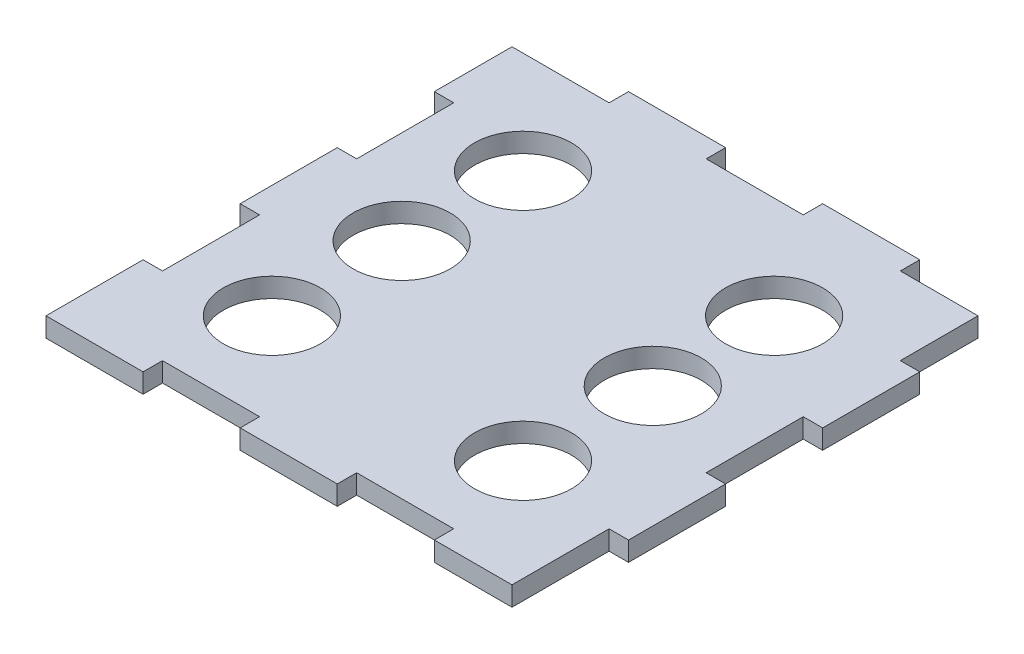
ISO-10303-21;
HEADER;
FILE_DESCRIPTION(('STEP AP214'),'2;1');
FILE_NAME('part.step','',(''),(''),'','','');
FILE_SCHEMA(('AUTOMOTIVE_DESIGN { 1 0 10303 214 1 1 1 1 }'));
ENDSEC;
DATA;
#1=APPLICATION_CONTEXT('core data for automotive mechanical design processes');
#2=APPLICATION_PROTOCOL_DEFINITION('international standard','automotive_design',2000,#1);
#3=PRODUCT_CONTEXT('',#1,'mechanical');
#4=PRODUCT('Part','Part','',(#3));
#5=PRODUCT_RELATED_PRODUCT_CATEGORY('part','',(#4));
#6=PRODUCT_DEFINITION_FORMATION('','',#4);
#7=PRODUCT_DEFINITION_CONTEXT('part definition',#1,'design');
#8=PRODUCT_DEFINITION('design','',#6,#7);
#9=PRODUCT_DEFINITION_SHAPE('','',#8);
#10=(LENGTH_UNIT() NAMED_UNIT(*) SI_UNIT(.MILLI.,.METRE.));
#11=(NAMED_UNIT(*) PLANE_ANGLE_UNIT() SI_UNIT($,.RADIAN.));
#12=(NAMED_UNIT(*) SI_UNIT($,.STERADIAN.) SOLID_ANGLE_UNIT());
#13=UNCERTAINTY_MEASURE_WITH_UNIT(LENGTH_MEASURE(1.E-05),#10,'distance_accuracy_value','');
#14=(GEOMETRIC_REPRESENTATION_CONTEXT(3) GLOBAL_UNCERTAINTY_ASSIGNED_CONTEXT((#13)) GLOBAL_UNIT_ASSIGNED_CONTEXT((#10,
#11,#12)) REPRESENTATION_CONTEXT('',''));
#15=CARTESIAN_POINT('',(0.,0.,0.));
#16=DIRECTION('',(0.,0.,1.));
#17=DIRECTION('',(1.,0.,0.));
#18=AXIS2_PLACEMENT_3D('',#15,#16,#17);
#19=CARTESIAN_POINT('',(0.,4.,0.));
#20=DIRECTION('',(0.,1.,0.));
#21=DIRECTION('',(0.,0.,1.));
#22=AXIS2_PLACEMENT_3D('',#19,#20,#21);
#23=PLANE('',#22);
#24=CARTESIAN_POINT('',(25.,4.,0.));
#25=DIRECTION('',(0.,1.,0.));
#26=DIRECTION('',(0.,0.,1.));
#27=AXIS2_PLACEMENT_3D('',#24,#25,#26);
#28=CIRCLE('',#27,9.99999999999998);
#29=CARTESIAN_POINT('',(25.,4.,9.99999999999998));
#30=VERTEX_POINT('',#29);
#31=EDGE_CURVE('E611',#30,#30,#28,.T.);
#32=ORIENTED_EDGE('',*,*,#31,.F.);
#33=EDGE_LOOP('',(#32));
#34=FACE_BOUND('',#33,.T.);
#35=CARTESIAN_POINT('',(-26.7320869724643,4.,26.7320869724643));
#36=DIRECTION('',(0.,1.,0.));
#37=DIRECTION('',(0.,0.,1.));
#38=AXIS2_PLACEMENT_3D('',#35,#36,#37);
#39=CIRCLE('',#38,10.);
#40=CARTESIAN_POINT('',(-26.7320869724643,4.,36.7320869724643));
#41=VERTEX_POINT('',#40);
#42=EDGE_CURVE('E623',#41,#41,#39,.T.);
#43=ORIENTED_EDGE('',*,*,#42,.F.);
#44=EDGE_LOOP('',(#43));
#45=FACE_BOUND('',#44,.T.);
#46=CARTESIAN_POINT('',(-26.7320869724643,4.,-25.));
#47=DIRECTION('',(0.,1.,0.));
#48=DIRECTION('',(0.,0.,1.));
#49=AXIS2_PLACEMENT_3D('',#46,#47,#48);
#50=CIRCLE('',#49,10.);
#51=CARTESIAN_POINT('',(-26.7320869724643,4.,-15.));
#52=VERTEX_POINT('',#51);
#53=EDGE_CURVE('E302',#52,#52,#50,.T.);
#54=ORIENTED_EDGE('',*,*,#53,.F.);
#55=EDGE_LOOP('',(#54));
#56=FACE_BOUND('',#55,.T.);
#57=DIRECTION('',(0.,0.,-1.));
#58=VECTOR('',#57,1.);
#59=CARTESIAN_POINT('',(46.,4.,30.));
#60=LINE('',#59,#58);
#61=CARTESIAN_POINT('',(46.,4.,50.));
#62=VERTEX_POINT('',#61);
#63=CARTESIAN_POINT('',(46.,4.,30.));
#64=VERTEX_POINT('',#63);
#65=EDGE_CURVE('E369',#62,#64,#60,.T.);
#66=ORIENTED_EDGE('',*,*,#65,.T.);
#67=DIRECTION('',(1.,0.,0.));
#68=VECTOR('',#67,1.);
#69=CARTESIAN_POINT('',(50.,4.,30.));
#70=LINE('',#69,#68);
#71=CARTESIAN_POINT('',(50.,4.,30.));
#72=VERTEX_POINT('',#71);
#73=EDGE_CURVE('E177',#64,#72,#70,.T.);
#74=ORIENTED_EDGE('',*,*,#73,.T.);
#75=DIRECTION('',(0.,0.,-1.));
#76=VECTOR('',#75,1.);
#77=CARTESIAN_POINT('',(50.,4.,9.99999999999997));
#78=LINE('',#77,#76);
#79=CARTESIAN_POINT('',(50.,4.,9.99999999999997));
#80=VERTEX_POINT('',#79);
#81=EDGE_CURVE('E468',#72,#80,#78,.T.);
#82=ORIENTED_EDGE('',*,*,#81,.T.);
#83=DIRECTION('',(-1.,0.,0.));
#84=VECTOR('',#83,1.);
#85=CARTESIAN_POINT('',(46.,4.,9.99999999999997));
#86=LINE('',#85,#84);
#87=CARTESIAN_POINT('',(46.,4.,9.99999999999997));
#88=VERTEX_POINT('',#87);
#89=EDGE_CURVE('E487',#80,#88,#86,.T.);
#90=ORIENTED_EDGE('',*,*,#89,.T.);
#91=DIRECTION('',(0.,0.,-1.));
#92=VECTOR('',#91,1.);
#93=CARTESIAN_POINT('',(46.,4.,-10.));
#94=LINE('',#93,#92);
#95=CARTESIAN_POINT('',(46.,4.,-10.));
#96=VERTEX_POINT('',#95);
#97=EDGE_CURVE('E484',#88,#96,#94,.T.);
#98=ORIENTED_EDGE('',*,*,#97,.T.);
#99=DIRECTION('',(1.,0.,0.));
#100=VECTOR('',#99,1.);
#101=CARTESIAN_POINT('',(50.,4.,-10.));
#102=LINE('',#101,#100);
#103=CARTESIAN_POINT('',(50.,4.,-10.));
#104=VERTEX_POINT('',#103);
#105=EDGE_CURVE('E486',#96,#104,#102,.T.);
#106=ORIENTED_EDGE('',*,*,#105,.T.);
#107=DIRECTION('',(0.,0.,-1.));
#108=VECTOR('',#107,1.);
#109=CARTESIAN_POINT('',(50.,4.,-30.));
#110=LINE('',#109,#108);
#111=CARTESIAN_POINT('',(50.,4.,-30.));
#112=VERTEX_POINT('',#111);
#113=EDGE_CURVE('E489',#104,#112,#110,.T.);
#114=ORIENTED_EDGE('',*,*,#113,.T.);
#115=DIRECTION('',(-1.,0.,0.));
#116=VECTOR('',#115,1.);
#117=CARTESIAN_POINT('',(46.,4.,-30.));
#118=LINE('',#117,#116);
#119=CARTESIAN_POINT('',(46.,4.,-30.));
#120=VERTEX_POINT('',#119);
#121=EDGE_CURVE('E495',#112,#120,#118,.T.);
#122=ORIENTED_EDGE('',*,*,#121,.T.);
#123=DIRECTION('',(0.,0.,-1.));
#124=VECTOR('',#123,1.);
#125=CARTESIAN_POINT('',(46.,4.,-46.));
#126=LINE('',#125,#124);
#127=CARTESIAN_POINT('',(46.,4.,-46.));
#128=VERTEX_POINT('',#127);
#129=EDGE_CURVE('E497',#120,#128,#126,.T.);
#130=ORIENTED_EDGE('',*,*,#129,.T.);
#131=DIRECTION('',(-1.,0.,0.));
#132=VECTOR('',#131,1.);
#133=CARTESIAN_POINT('',(30.,4.,-46.));
#134=LINE('',#133,#132);
#135=CARTESIAN_POINT('',(30.,4.,-46.));
#136=VERTEX_POINT('',#135);
#137=EDGE_CURVE('E499',#128,#136,#134,.T.);
#138=ORIENTED_EDGE('',*,*,#137,.T.);
#139=DIRECTION('',(0.,0.,-1.));
#140=VECTOR('',#139,1.);
#141=CARTESIAN_POINT('',(30.,4.,-50.));
#142=LINE('',#141,#140);
#143=CARTESIAN_POINT('',(30.,4.,-50.));
#144=VERTEX_POINT('',#143);
#145=EDGE_CURVE('E501',#136,#144,#142,.T.);
#146=ORIENTED_EDGE('',*,*,#145,.T.);
#147=DIRECTION('',(-1.,0.,0.));
#148=VECTOR('',#147,1.);
#149=CARTESIAN_POINT('',(9.99999999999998,4.,-50.));
#150=LINE('',#149,#148);
#151=CARTESIAN_POINT('',(9.99999999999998,4.,-50.));
#152=VERTEX_POINT('',#151);
#153=EDGE_CURVE('E503',#144,#152,#150,.T.);
#154=ORIENTED_EDGE('',*,*,#153,.T.);
#155=DIRECTION('',(0.,0.,1.));
#156=VECTOR('',#155,1.);
#157=CARTESIAN_POINT('',(9.99999999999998,4.,-46.));
#158=LINE('',#157,#156);
#159=CARTESIAN_POINT('',(9.99999999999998,4.,-46.));
#160=VERTEX_POINT('',#159);
#161=EDGE_CURVE('E505',#152,#160,#158,.T.);
#162=ORIENTED_EDGE('',*,*,#161,.T.);
#163=DIRECTION('',(-1.,0.,0.));
#164=VECTOR('',#163,1.);
#165=CARTESIAN_POINT('',(-10.,4.,-46.));
#166=LINE('',#165,#164);
#167=CARTESIAN_POINT('',(-10.,4.,-46.));
#168=VERTEX_POINT('',#167);
#169=EDGE_CURVE('E507',#160,#168,#166,.T.);
#170=ORIENTED_EDGE('',*,*,#169,.T.);
#171=DIRECTION('',(0.,0.,-1.));
#172=VECTOR('',#171,1.);
#173=CARTESIAN_POINT('',(-10.,4.,-50.));
#174=LINE('',#173,#172);
#175=CARTESIAN_POINT('',(-10.,4.,-50.));
#176=VERTEX_POINT('',#175);
#177=EDGE_CURVE('E509',#168,#176,#174,.T.);
#178=ORIENTED_EDGE('',*,*,#177,.T.);
#179=DIRECTION('',(-1.,0.,0.));
#180=VECTOR('',#179,1.);
#181=CARTESIAN_POINT('',(-30.,4.,-50.));
#182=LINE('',#181,#180);
#183=CARTESIAN_POINT('',(-30.,4.,-50.));
#184=VERTEX_POINT('',#183);
#185=EDGE_CURVE('E511',#176,#184,#182,.T.);
#186=ORIENTED_EDGE('',*,*,#185,.T.);
#187=DIRECTION('',(0.,0.,1.));
#188=VECTOR('',#187,1.);
#189=CARTESIAN_POINT('',(-30.,4.,-46.));
#190=LINE('',#189,#188);
#191=CARTESIAN_POINT('',(-30.,4.,-46.));
#192=VERTEX_POINT('',#191);
#193=EDGE_CURVE('E513',#184,#192,#190,.T.);
#194=ORIENTED_EDGE('',*,*,#193,.T.);
#195=DIRECTION('',(-1.,0.,0.));
#196=VECTOR('',#195,1.);
#197=CARTESIAN_POINT('',(-50.,4.,-46.));
#198=LINE('',#197,#196);
#199=CARTESIAN_POINT('',(-50.,4.,-46.));
#200=VERTEX_POINT('',#199);
#201=EDGE_CURVE('E515',#192,#200,#198,.T.);
#202=ORIENTED_EDGE('',*,*,#201,.T.);
#203=DIRECTION('',(0.,0.,1.));
#204=VECTOR('',#203,1.);
#205=CARTESIAN_POINT('',(-50.,4.,-46.));
#206=LINE('',#205,#204);
#207=CARTESIAN_POINT('',(-50.,4.,-30.));
#208=VERTEX_POINT('',#207);
#209=EDGE_CURVE('E517',#200,#208,#206,.T.);
#210=ORIENTED_EDGE('',*,*,#209,.T.);
#211=DIRECTION('',(1.,0.,0.));
#212=VECTOR('',#211,1.);
#213=CARTESIAN_POINT('',(-50.,4.,-30.));
#214=LINE('',#213,#212);
#215=CARTESIAN_POINT('',(-46.,4.,-30.));
#216=VERTEX_POINT('',#215);
#217=EDGE_CURVE('E519',#208,#216,#214,.T.);
#218=ORIENTED_EDGE('',*,*,#217,.T.);
#219=DIRECTION('',(0.,0.,1.));
#220=VECTOR('',#219,1.);
#221=CARTESIAN_POINT('',(-46.,4.,-30.));
#222=LINE('',#221,#220);
#223=CARTESIAN_POINT('',(-46.,4.,-10.));
#224=VERTEX_POINT('',#223);
#225=EDGE_CURVE('E521',#216,#224,#222,.T.);
#226=ORIENTED_EDGE('',*,*,#225,.T.);
#227=DIRECTION('',(-1.,0.,0.));
#228=VECTOR('',#227,1.);
#229=CARTESIAN_POINT('',(-46.,4.,-10.));
#230=LINE('',#229,#228);
#231=CARTESIAN_POINT('',(-50.,4.,-10.));
#232=VERTEX_POINT('',#231);
#233=EDGE_CURVE('E523',#224,#232,#230,.T.);
#234=ORIENTED_EDGE('',*,*,#233,.T.);
#235=DIRECTION('',(0.,0.,1.));
#236=VECTOR('',#235,1.);
#237=CARTESIAN_POINT('',(-50.,4.,-10.));
#238=LINE('',#237,#236);
#239=CARTESIAN_POINT('',(-50.,4.,9.99999999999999));
#240=VERTEX_POINT('',#239);
#241=EDGE_CURVE('E525',#232,#240,#238,.T.);
#242=ORIENTED_EDGE('',*,*,#241,.T.);
#243=DIRECTION('',(1.,0.,0.));
#244=VECTOR('',#243,1.);
#245=CARTESIAN_POINT('',(-50.,4.,9.99999999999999));
#246=LINE('',#245,#244);
#247=CARTESIAN_POINT('',(-46.,4.,9.99999999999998));
#248=VERTEX_POINT('',#247);
#249=EDGE_CURVE('E527',#240,#248,#246,.T.);
#250=ORIENTED_EDGE('',*,*,#249,.T.);
#251=DIRECTION('',(0.,0.,1.));
#252=VECTOR('',#251,1.);
#253=CARTESIAN_POINT('',(-46.,4.,9.99999999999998));
#254=LINE('',#253,#252);
#255=CARTESIAN_POINT('',(-46.,4.,30.));
#256=VERTEX_POINT('',#255);
#257=EDGE_CURVE('E529',#248,#256,#254,.T.);
#258=ORIENTED_EDGE('',*,*,#257,.T.);
#259=DIRECTION('',(-1.,0.,0.));
#260=VECTOR('',#259,1.);
#261=CARTESIAN_POINT('',(-46.,4.,30.));
#262=LINE('',#261,#260);
#263=CARTESIAN_POINT('',(-50.,4.,30.));
#264=VERTEX_POINT('',#263);
#265=EDGE_CURVE('E531',#256,#264,#262,.T.);
#266=ORIENTED_EDGE('',*,*,#265,.T.);
#267=DIRECTION('',(0.,0.,1.));
#268=VECTOR('',#267,1.);
#269=CARTESIAN_POINT('',(-50.,4.,30.));
#270=LINE('',#269,#268);
#271=CARTESIAN_POINT('',(-50.,4.,50.));
#272=VERTEX_POINT('',#271);
#273=EDGE_CURVE('E533',#264,#272,#270,.T.);
#274=ORIENTED_EDGE('',*,*,#273,.T.);
#275=DIRECTION('',(1.,0.,0.));
#276=VECTOR('',#275,1.);
#277=CARTESIAN_POINT('',(-50.,4.,50.));
#278=LINE('',#277,#276);
#279=CARTESIAN_POINT('',(-30.,4.,50.));
#280=VERTEX_POINT('',#279);
#281=EDGE_CURVE('E535',#272,#280,#278,.T.);
#282=ORIENTED_EDGE('',*,*,#281,.T.);
#283=DIRECTION('',(0.,0.,-1.));
#284=VECTOR('',#283,1.);
#285=CARTESIAN_POINT('',(-30.,4.,50.));
#286=LINE('',#285,#284);
#287=CARTESIAN_POINT('',(-30.,4.,46.));
#288=VERTEX_POINT('',#287);
#289=EDGE_CURVE('E537',#280,#288,#286,.T.);
#290=ORIENTED_EDGE('',*,*,#289,.T.);
#291=DIRECTION('',(1.,0.,0.));
#292=VECTOR('',#291,1.);
#293=CARTESIAN_POINT('',(-30.,4.,46.));
#294=LINE('',#293,#292);
#295=CARTESIAN_POINT('',(-10.,4.,46.));
#296=VERTEX_POINT('',#295);
#297=EDGE_CURVE('E539',#288,#296,#294,.T.);
#298=ORIENTED_EDGE('',*,*,#297,.T.);
#299=DIRECTION('',(0.,0.,1.));
#300=VECTOR('',#299,1.);
#301=CARTESIAN_POINT('',(-10.,4.,46.));
#302=LINE('',#301,#300);
#303=CARTESIAN_POINT('',(-10.,4.,50.));
#304=VERTEX_POINT('',#303);
#305=EDGE_CURVE('E541',#296,#304,#302,.T.);
#306=ORIENTED_EDGE('',*,*,#305,.T.);
#307=DIRECTION('',(1.,0.,0.));
#308=VECTOR('',#307,1.);
#309=CARTESIAN_POINT('',(-10.,4.,50.));
#310=LINE('',#309,#308);
#311=CARTESIAN_POINT('',(9.99999999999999,4.,50.));
#312=VERTEX_POINT('',#311);
#313=EDGE_CURVE('E543',#304,#312,#310,.T.);
#314=ORIENTED_EDGE('',*,*,#313,.T.);
#315=DIRECTION('',(0.,0.,-1.));
#316=VECTOR('',#315,1.);
#317=CARTESIAN_POINT('',(9.99999999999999,4.,50.));
#318=LINE('',#317,#316);
#319=CARTESIAN_POINT('',(9.99999999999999,4.,46.));
#320=VERTEX_POINT('',#319);
#321=EDGE_CURVE('E280',#312,#320,#318,.T.);
#322=ORIENTED_EDGE('',*,*,#321,.T.);
#323=DIRECTION('',(1.,0.,0.));
#324=VECTOR('',#323,1.);
#325=CARTESIAN_POINT('',(9.99999999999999,4.,46.));
#326=LINE('',#325,#324);
#327=CARTESIAN_POINT('',(30.,4.,46.));
#328=VERTEX_POINT('',#327);
#329=EDGE_CURVE('E274',#320,#328,#326,.T.);
#330=ORIENTED_EDGE('',*,*,#329,.T.);
#331=DIRECTION('',(0.,0.,1.));
#332=VECTOR('',#331,1.);
#333=CARTESIAN_POINT('',(30.,4.,46.));
#334=LINE('',#333,#332);
#335=CARTESIAN_POINT('',(30.,4.,50.));
#336=VERTEX_POINT('',#335);
#337=EDGE_CURVE('E278',#328,#336,#334,.T.);
#338=ORIENTED_EDGE('',*,*,#337,.T.);
#339=DIRECTION('',(1.,0.,0.));
#340=VECTOR('',#339,1.);
#341=CARTESIAN_POINT('',(30.,4.,50.));
#342=LINE('',#341,#340);
#343=EDGE_CURVE('E50',#336,#62,#342,.T.);
#344=ORIENTED_EDGE('',*,*,#343,.T.);
#345=EDGE_LOOP('',(#66,#74,#82,#90,#98,#106,#114,#122,#130,#138,#146,#154,#162,#170,#178,#186,
#194,#202,#210,#218,#226,#234,#242,#250,#258,#266,#274,#282,#290,#298,#306,#314,#322,#330,#338,#344));
#346=FACE_BOUND('',#345,.T.);
#347=CARTESIAN_POINT('',(-26.7320869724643,4.,0.));
#348=DIRECTION('',(0.,1.,0.));
#349=DIRECTION('',(0.,0.,1.));
#350=AXIS2_PLACEMENT_3D('',#347,#348,#349);
#351=CIRCLE('',#350,9.99999999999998);
#352=CARTESIAN_POINT('',(-26.7320869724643,4.,10.));
#353=VERTEX_POINT('',#352);
#354=EDGE_CURVE('E629',#353,#353,#351,.T.);
#355=ORIENTED_EDGE('',*,*,#354,.F.);
#356=EDGE_LOOP('',(#355));
#357=FACE_BOUND('',#356,.T.);
#358=CARTESIAN_POINT('',(25.,4.,-25.));
#359=DIRECTION('',(0.,1.,0.));
#360=DIRECTION('',(0.,0.,1.));
#361=AXIS2_PLACEMENT_3D('',#358,#359,#360);
#362=CIRCLE('',#361,10.);
#363=CARTESIAN_POINT('',(25.,4.,-15.));
#364=VERTEX_POINT('',#363);
#365=EDGE_CURVE('E617',#364,#364,#362,.T.);
#366=ORIENTED_EDGE('',*,*,#365,.F.);
#367=EDGE_LOOP('',(#366));
#368=FACE_BOUND('',#367,.T.);
#369=CARTESIAN_POINT('',(25.,4.,26.7320869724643));
#370=DIRECTION('',(0.,1.,0.));
#371=DIRECTION('',(0.,0.,1.));
#372=AXIS2_PLACEMENT_3D('',#369,#370,#371);
#373=CIRCLE('',#372,10.);
#374=CARTESIAN_POINT('',(25.,4.,36.7320869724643));
#375=VERTEX_POINT('',#374);
#376=EDGE_CURVE('E602',#375,#375,#373,.T.);
#377=ORIENTED_EDGE('',*,*,#376,.F.);
#378=EDGE_LOOP('',(#377));
#379=FACE_BOUND('',#378,.T.);
#380=ADVANCED_FACE('F33',(#34,#45,#56,#346,#357,#368,#379),#23,.T.);
#381=CARTESIAN_POINT('',(0.,0.,0.));
#382=DIRECTION('',(0.,1.,0.));
#383=DIRECTION('',(0.,0.,1.));
#384=AXIS2_PLACEMENT_3D('',#381,#382,#383);
#385=PLANE('',#384);
#386=DIRECTION('',(0.,0.,-1.));
#387=VECTOR('',#386,1.);
#388=CARTESIAN_POINT('',(46.,0.,30.));
#389=LINE('',#388,#387);
#390=CARTESIAN_POINT('',(46.,0.,50.));
#391=VERTEX_POINT('',#390);
#392=CARTESIAN_POINT('',(46.,0.,30.));
#393=VERTEX_POINT('',#392);
#394=EDGE_CURVE('E298',#391,#393,#389,.T.);
#395=ORIENTED_EDGE('',*,*,#394,.F.);
#396=DIRECTION('',(1.,0.,0.));
#397=VECTOR('',#396,1.);
#398=CARTESIAN_POINT('',(30.,0.,50.));
#399=LINE('',#398,#397);
#400=CARTESIAN_POINT('',(30.,0.,50.));
#401=VERTEX_POINT('',#400);
#402=EDGE_CURVE('E169',#401,#391,#399,.T.);
#403=ORIENTED_EDGE('',*,*,#402,.F.);
#404=DIRECTION('',(0.,0.,1.));
#405=VECTOR('',#404,1.);
#406=CARTESIAN_POINT('',(30.,0.,46.));
#407=LINE('',#406,#405);
#408=CARTESIAN_POINT('',(30.,0.,46.));
#409=VERTEX_POINT('',#408);
#410=EDGE_CURVE('E163',#409,#401,#407,.T.);
#411=ORIENTED_EDGE('',*,*,#410,.F.);
#412=DIRECTION('',(1.,0.,0.));
#413=VECTOR('',#412,1.);
#414=CARTESIAN_POINT('',(9.99999999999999,0.,46.));
#415=LINE('',#414,#413);
#416=CARTESIAN_POINT('',(9.99999999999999,0.,46.));
#417=VERTEX_POINT('',#416);
#418=EDGE_CURVE('E288',#417,#409,#415,.T.);
#419=ORIENTED_EDGE('',*,*,#418,.F.);
#420=DIRECTION('',(0.,0.,-1.));
#421=VECTOR('',#420,1.);
#422=CARTESIAN_POINT('',(9.99999999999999,0.,50.));
#423=LINE('',#422,#421);
#424=CARTESIAN_POINT('',(9.99999999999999,0.,50.));
#425=VERTEX_POINT('',#424);
#426=EDGE_CURVE('E364',#425,#417,#423,.T.);
#427=ORIENTED_EDGE('',*,*,#426,.F.);
#428=DIRECTION('',(1.,0.,0.));
#429=VECTOR('',#428,1.);
#430=CARTESIAN_POINT('',(-10.,0.,50.));
#431=LINE('',#430,#429);
#432=CARTESIAN_POINT('',(-10.,0.,50.));
#433=VERTEX_POINT('',#432);
#434=EDGE_CURVE('E362',#433,#425,#431,.T.);
#435=ORIENTED_EDGE('',*,*,#434,.F.);
#436=DIRECTION('',(0.,0.,1.));
#437=VECTOR('',#436,1.);
#438=CARTESIAN_POINT('',(-10.,0.,46.));
#439=LINE('',#438,#437);
#440=CARTESIAN_POINT('',(-10.,0.,46.));
#441=VERTEX_POINT('',#440);
#442=EDGE_CURVE('E360',#441,#433,#439,.T.);
#443=ORIENTED_EDGE('',*,*,#442,.F.);
#444=DIRECTION('',(1.,0.,0.));
#445=VECTOR('',#444,1.);
#446=CARTESIAN_POINT('',(-30.,0.,46.));
#447=LINE('',#446,#445);
#448=CARTESIAN_POINT('',(-30.,0.,46.));
#449=VERTEX_POINT('',#448);
#450=EDGE_CURVE('E358',#449,#441,#447,.T.);
#451=ORIENTED_EDGE('',*,*,#450,.F.);
#452=DIRECTION('',(0.,0.,-1.));
#453=VECTOR('',#452,1.);
#454=CARTESIAN_POINT('',(-30.,0.,50.));
#455=LINE('',#454,#453);
#456=CARTESIAN_POINT('',(-30.,0.,50.));
#457=VERTEX_POINT('',#456);
#458=EDGE_CURVE('E356',#457,#449,#455,.T.);
#459=ORIENTED_EDGE('',*,*,#458,.F.);
#460=DIRECTION('',(1.,0.,0.));
#461=VECTOR('',#460,1.);
#462=CARTESIAN_POINT('',(-50.,0.,50.));
#463=LINE('',#462,#461);
#464=CARTESIAN_POINT('',(-50.,0.,50.));
#465=VERTEX_POINT('',#464);
#466=EDGE_CURVE('E354',#465,#457,#463,.T.);
#467=ORIENTED_EDGE('',*,*,#466,.F.);
#468=DIRECTION('',(0.,0.,1.));
#469=VECTOR('',#468,1.);
#470=CARTESIAN_POINT('',(-50.,0.,30.));
#471=LINE('',#470,#469);
#472=CARTESIAN_POINT('',(-50.,0.,30.));
#473=VERTEX_POINT('',#472);
#474=EDGE_CURVE('E352',#473,#465,#471,.T.);
#475=ORIENTED_EDGE('',*,*,#474,.F.);
#476=DIRECTION('',(-1.,0.,0.));
#477=VECTOR('',#476,1.);
#478=CARTESIAN_POINT('',(-46.,0.,30.));
#479=LINE('',#478,#477);
#480=CARTESIAN_POINT('',(-46.,0.,30.));
#481=VERTEX_POINT('',#480);
#482=EDGE_CURVE('E350',#481,#473,#479,.T.);
#483=ORIENTED_EDGE('',*,*,#482,.F.);
#484=DIRECTION('',(0.,0.,1.));
#485=VECTOR('',#484,1.);
#486=CARTESIAN_POINT('',(-46.,0.,9.99999999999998));
#487=LINE('',#486,#485);
#488=CARTESIAN_POINT('',(-46.,0.,9.99999999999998));
#489=VERTEX_POINT('',#488);
#490=EDGE_CURVE('E348',#489,#481,#487,.T.);
#491=ORIENTED_EDGE('',*,*,#490,.F.);
#492=DIRECTION('',(1.,0.,0.));
#493=VECTOR('',#492,1.);
#494=CARTESIAN_POINT('',(-50.,0.,9.99999999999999));
#495=LINE('',#494,#493);
#496=CARTESIAN_POINT('',(-50.,0.,9.99999999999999));
#497=VERTEX_POINT('',#496);
#498=EDGE_CURVE('E346',#497,#489,#495,.T.);
#499=ORIENTED_EDGE('',*,*,#498,.F.);
#500=DIRECTION('',(0.,0.,1.));
#501=VECTOR('',#500,1.);
#502=CARTESIAN_POINT('',(-50.,0.,-10.));
#503=LINE('',#502,#501);
#504=CARTESIAN_POINT('',(-50.,0.,-10.));
#505=VERTEX_POINT('',#504);
#506=EDGE_CURVE('E344',#505,#497,#503,.T.);
#507=ORIENTED_EDGE('',*,*,#506,.F.);
#508=DIRECTION('',(-1.,0.,0.));
#509=VECTOR('',#508,1.);
#510=CARTESIAN_POINT('',(-46.,0.,-10.));
#511=LINE('',#510,#509);
#512=CARTESIAN_POINT('',(-46.,0.,-10.));
#513=VERTEX_POINT('',#512);
#514=EDGE_CURVE('E342',#513,#505,#511,.T.);
#515=ORIENTED_EDGE('',*,*,#514,.F.);
#516=DIRECTION('',(0.,0.,1.));
#517=VECTOR('',#516,1.);
#518=CARTESIAN_POINT('',(-46.,0.,-30.));
#519=LINE('',#518,#517);
#520=CARTESIAN_POINT('',(-46.,0.,-30.));
#521=VERTEX_POINT('',#520);
#522=EDGE_CURVE('E340',#521,#513,#519,.T.);
#523=ORIENTED_EDGE('',*,*,#522,.F.);
#524=DIRECTION('',(1.,0.,0.));
#525=VECTOR('',#524,1.);
#526=CARTESIAN_POINT('',(-50.,0.,-30.));
#527=LINE('',#526,#525);
#528=CARTESIAN_POINT('',(-50.,0.,-30.));
#529=VERTEX_POINT('',#528);
#530=EDGE_CURVE('E338',#529,#521,#527,.T.);
#531=ORIENTED_EDGE('',*,*,#530,.F.);
#532=DIRECTION('',(0.,0.,1.));
#533=VECTOR('',#532,1.);
#534=CARTESIAN_POINT('',(-50.,0.,-46.));
#535=LINE('',#534,#533);
#536=CARTESIAN_POINT('',(-50.,0.,-46.));
#537=VERTEX_POINT('',#536);
#538=EDGE_CURVE('E336',#537,#529,#535,.T.);
#539=ORIENTED_EDGE('',*,*,#538,.F.);
#540=DIRECTION('',(-1.,0.,0.));
#541=VECTOR('',#540,1.);
#542=CARTESIAN_POINT('',(-50.,0.,-46.));
#543=LINE('',#542,#541);
#544=CARTESIAN_POINT('',(-30.,0.,-46.));
#545=VERTEX_POINT('',#544);
#546=EDGE_CURVE('E334',#545,#537,#543,.T.);
#547=ORIENTED_EDGE('',*,*,#546,.F.);
#548=DIRECTION('',(0.,0.,1.));
#549=VECTOR('',#548,1.);
#550=CARTESIAN_POINT('',(-30.,0.,-46.));
#551=LINE('',#550,#549);
#552=CARTESIAN_POINT('',(-30.,0.,-50.));
#553=VERTEX_POINT('',#552);
#554=EDGE_CURVE('E332',#553,#545,#551,.T.);
#555=ORIENTED_EDGE('',*,*,#554,.F.);
#556=DIRECTION('',(-1.,0.,0.));
#557=VECTOR('',#556,1.);
#558=CARTESIAN_POINT('',(-30.,0.,-50.));
#559=LINE('',#558,#557);
#560=CARTESIAN_POINT('',(-10.,0.,-50.));
#561=VERTEX_POINT('',#560);
#562=EDGE_CURVE('E330',#561,#553,#559,.T.);
#563=ORIENTED_EDGE('',*,*,#562,.F.);
#564=DIRECTION('',(0.,0.,-1.));
#565=VECTOR('',#564,1.);
#566=CARTESIAN_POINT('',(-10.,0.,-50.));
#567=LINE('',#566,#565);
#568=CARTESIAN_POINT('',(-10.,0.,-46.));
#569=VERTEX_POINT('',#568);
#570=EDGE_CURVE('E328',#569,#561,#567,.T.);
#571=ORIENTED_EDGE('',*,*,#570,.F.);
#572=DIRECTION('',(-1.,0.,0.));
#573=VECTOR('',#572,1.);
#574=CARTESIAN_POINT('',(-10.,0.,-46.));
#575=LINE('',#574,#573);
#576=CARTESIAN_POINT('',(9.99999999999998,0.,-46.));
#577=VERTEX_POINT('',#576);
#578=EDGE_CURVE('E326',#577,#569,#575,.T.);
#579=ORIENTED_EDGE('',*,*,#578,.F.);
#580=DIRECTION('',(0.,0.,1.));
#581=VECTOR('',#580,1.);
#582=CARTESIAN_POINT('',(9.99999999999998,0.,-46.));
#583=LINE('',#582,#581);
#584=CARTESIAN_POINT('',(9.99999999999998,0.,-50.));
#585=VERTEX_POINT('',#584);
#586=EDGE_CURVE('E324',#585,#577,#583,.T.);
#587=ORIENTED_EDGE('',*,*,#586,.F.);
#588=DIRECTION('',(-1.,0.,0.));
#589=VECTOR('',#588,1.);
#590=CARTESIAN_POINT('',(9.99999999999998,0.,-50.));
#591=LINE('',#590,#589);
#592=CARTESIAN_POINT('',(30.,0.,-50.));
#593=VERTEX_POINT('',#592);
#594=EDGE_CURVE('E322',#593,#585,#591,.T.);
#595=ORIENTED_EDGE('',*,*,#594,.F.);
#596=DIRECTION('',(0.,0.,-1.));
#597=VECTOR('',#596,1.);
#598=CARTESIAN_POINT('',(30.,0.,-50.));
#599=LINE('',#598,#597);
#600=CARTESIAN_POINT('',(30.,0.,-46.));
#601=VERTEX_POINT('',#600);
#602=EDGE_CURVE('E320',#601,#593,#599,.T.);
#603=ORIENTED_EDGE('',*,*,#602,.F.);
#604=DIRECTION('',(-1.,0.,0.));
#605=VECTOR('',#604,1.);
#606=CARTESIAN_POINT('',(30.,0.,-46.));
#607=LINE('',#606,#605);
#608=CARTESIAN_POINT('',(46.,0.,-46.));
#609=VERTEX_POINT('',#608);
#610=EDGE_CURVE('E318',#609,#601,#607,.T.);
#611=ORIENTED_EDGE('',*,*,#610,.F.);
#612=DIRECTION('',(0.,0.,-1.));
#613=VECTOR('',#612,1.);
#614=CARTESIAN_POINT('',(46.,0.,-46.));
#615=LINE('',#614,#613);
#616=CARTESIAN_POINT('',(46.,0.,-30.));
#617=VERTEX_POINT('',#616);
#618=EDGE_CURVE('E316',#617,#609,#615,.T.);
#619=ORIENTED_EDGE('',*,*,#618,.F.);
#620=DIRECTION('',(-1.,0.,0.));
#621=VECTOR('',#620,1.);
#622=CARTESIAN_POINT('',(46.,0.,-30.));
#623=LINE('',#622,#621);
#624=CARTESIAN_POINT('',(50.,0.,-30.));
#625=VERTEX_POINT('',#624);
#626=EDGE_CURVE('E314',#625,#617,#623,.T.);
#627=ORIENTED_EDGE('',*,*,#626,.F.);
#628=DIRECTION('',(0.,0.,-1.));
#629=VECTOR('',#628,1.);
#630=CARTESIAN_POINT('',(50.,0.,-30.));
#631=LINE('',#630,#629);
#632=CARTESIAN_POINT('',(50.,0.,-10.));
#633=VERTEX_POINT('',#632);
#634=EDGE_CURVE('E312',#633,#625,#631,.T.);
#635=ORIENTED_EDGE('',*,*,#634,.F.);
#636=DIRECTION('',(1.,0.,0.));
#637=VECTOR('',#636,1.);
#638=CARTESIAN_POINT('',(50.,0.,-10.));
#639=LINE('',#638,#637);
#640=CARTESIAN_POINT('',(46.,0.,-10.));
#641=VERTEX_POINT('',#640);
#642=EDGE_CURVE('E310',#641,#633,#639,.T.);
#643=ORIENTED_EDGE('',*,*,#642,.F.);
#644=DIRECTION('',(0.,0.,-1.));
#645=VECTOR('',#644,1.);
#646=CARTESIAN_POINT('',(46.,0.,-10.));
#647=LINE('',#646,#645);
#648=CARTESIAN_POINT('',(46.,0.,9.99999999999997));
#649=VERTEX_POINT('',#648);
#650=EDGE_CURVE('E308',#649,#641,#647,.T.);
#651=ORIENTED_EDGE('',*,*,#650,.F.);
#652=DIRECTION('',(-1.,0.,0.));
#653=VECTOR('',#652,1.);
#654=CARTESIAN_POINT('',(46.,0.,9.99999999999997));
#655=LINE('',#654,#653);
#656=CARTESIAN_POINT('',(50.,0.,9.99999999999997));
#657=VERTEX_POINT('',#656);
#658=EDGE_CURVE('E306',#657,#649,#655,.T.);
#659=ORIENTED_EDGE('',*,*,#658,.F.);
#660=DIRECTION('',(0.,0.,-1.));
#661=VECTOR('',#660,1.);
#662=CARTESIAN_POINT('',(50.,0.,9.99999999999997));
#663=LINE('',#662,#661);
#664=CARTESIAN_POINT('',(50.,0.,30.));
#665=VERTEX_POINT('',#664);
#666=EDGE_CURVE('E304',#665,#657,#663,.T.);
#667=ORIENTED_EDGE('',*,*,#666,.F.);
#668=DIRECTION('',(1.,0.,0.));
#669=VECTOR('',#668,1.);
#670=CARTESIAN_POINT('',(50.,0.,30.));
#671=LINE('',#670,#669);
#672=EDGE_CURVE('E301',#393,#665,#671,.T.);
#673=ORIENTED_EDGE('',*,*,#672,.F.);
#674=EDGE_LOOP('',(#395,#403,#411,#419,#427,#435,#443,#451,#459,#467,#475,#483,#491,#499,#507,
#515,#523,#531,#539,#547,#555,#563,#571,#579,#587,#595,#603,#611,#619,#627,#635,#643,#651,#659,
#667,#673));
#675=FACE_BOUND('',#674,.T.);
#676=CARTESIAN_POINT('',(-26.7320869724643,0.,-25.));
#677=DIRECTION('',(0.,1.,0.));
#678=DIRECTION('',(0.,0.,1.));
#679=AXIS2_PLACEMENT_3D('',#676,#677,#678);
#680=CIRCLE('',#679,10.);
#681=CARTESIAN_POINT('',(-26.7320869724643,0.,-15.));
#682=VERTEX_POINT('',#681);
#683=EDGE_CURVE('E632',#682,#682,#680,.T.);
#684=ORIENTED_EDGE('',*,*,#683,.T.);
#685=EDGE_LOOP('',(#684));
#686=FACE_BOUND('',#685,.T.);
#687=CARTESIAN_POINT('',(-26.7320869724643,0.,0.));
#688=DIRECTION('',(0.,1.,0.));
#689=DIRECTION('',(0.,0.,1.));
#690=AXIS2_PLACEMENT_3D('',#687,#688,#689);
#691=CIRCLE('',#690,9.99999999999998);
#692=CARTESIAN_POINT('',(-26.7320869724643,0.,10.));
#693=VERTEX_POINT('',#692);
#694=EDGE_CURVE('E626',#693,#693,#691,.T.);
#695=ORIENTED_EDGE('',*,*,#694,.T.);
#696=EDGE_LOOP('',(#695));
#697=FACE_BOUND('',#696,.T.);
#698=CARTESIAN_POINT('',(-26.7320869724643,0.,26.7320869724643));
#699=DIRECTION('',(0.,1.,0.));
#700=DIRECTION('',(0.,0.,1.));
#701=AXIS2_PLACEMENT_3D('',#698,#699,#700);
#702=CIRCLE('',#701,10.);
#703=CARTESIAN_POINT('',(-26.7320869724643,0.,36.7320869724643));
#704=VERTEX_POINT('',#703);
#705=EDGE_CURVE('E620',#704,#704,#702,.T.);
#706=ORIENTED_EDGE('',*,*,#705,.T.);
#707=EDGE_LOOP('',(#706));
#708=FACE_BOUND('',#707,.T.);
#709=CARTESIAN_POINT('',(25.,0.,-25.));
#710=DIRECTION('',(0.,1.,0.));
#711=DIRECTION('',(0.,0.,1.));
#712=AXIS2_PLACEMENT_3D('',#709,#710,#711);
#713=CIRCLE('',#712,10.);
#714=CARTESIAN_POINT('',(25.,0.,-15.));
#715=VERTEX_POINT('',#714);
#716=EDGE_CURVE('E614',#715,#715,#713,.T.);
#717=ORIENTED_EDGE('',*,*,#716,.T.);
#718=EDGE_LOOP('',(#717));
#719=FACE_BOUND('',#718,.T.);
#720=CARTESIAN_POINT('',(25.,0.,0.));
#721=DIRECTION('',(0.,1.,0.));
#722=DIRECTION('',(0.,0.,1.));
#723=AXIS2_PLACEMENT_3D('',#720,#721,#722);
#724=CIRCLE('',#723,9.99999999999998);
#725=CARTESIAN_POINT('',(25.,0.,9.99999999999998));
#726=VERTEX_POINT('',#725);
#727=EDGE_CURVE('E608',#726,#726,#724,.T.);
#728=ORIENTED_EDGE('',*,*,#727,.T.);
#729=EDGE_LOOP('',(#728));
#730=FACE_BOUND('',#729,.T.);
#731=CARTESIAN_POINT('',(25.,0.,26.7320869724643));
#732=DIRECTION('',(0.,1.,0.));
#733=DIRECTION('',(0.,0.,1.));
#734=AXIS2_PLACEMENT_3D('',#731,#732,#733);
#735=CIRCLE('',#734,10.);
#736=CARTESIAN_POINT('',(25.,0.,36.7320869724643));
#737=VERTEX_POINT('',#736);
#738=EDGE_CURVE('E605',#737,#737,#735,.T.);
#739=ORIENTED_EDGE('',*,*,#738,.T.);
#740=EDGE_LOOP('',(#739));
#741=FACE_BOUND('',#740,.T.);
#742=ADVANCED_FACE('F472',(#675,#686,#697,#708,#719,#730,#741),#385,.F.);
#743=CARTESIAN_POINT('',(46.,4.,30.));
#744=DIRECTION('',(-1.,0.,0.));
#745=DIRECTION('',(0.,0.,1.));
#746=AXIS2_PLACEMENT_3D('',#743,#744,#745);
#747=PLANE('',#746);
#748=ORIENTED_EDGE('',*,*,#394,.T.);
#749=DIRECTION('',(0.,-1.,0.));
#750=VECTOR('',#749,1.);
#751=CARTESIAN_POINT('',(46.,4.,30.));
#752=LINE('',#751,#750);
#753=EDGE_CURVE('E11',#64,#393,#752,.T.);
#754=ORIENTED_EDGE('',*,*,#753,.F.);
#755=ORIENTED_EDGE('',*,*,#65,.F.);
#756=DIRECTION('',(0.,-1.,0.));
#757=VECTOR('',#756,1.);
#758=CARTESIAN_POINT('',(46.,4.,50.));
#759=LINE('',#758,#757);
#760=EDGE_CURVE('E294',#62,#391,#759,.T.);
#761=ORIENTED_EDGE('',*,*,#760,.T.);
#762=EDGE_LOOP('',(#748,#754,#755,#761));
#763=FACE_BOUND('',#762,.T.);
#764=ADVANCED_FACE('F35',(#763),#747,.F.);
#765=CARTESIAN_POINT('',(50.,4.,30.));
#766=DIRECTION('',(0.,0.,-1.));
#767=DIRECTION('',(-1.,0.,0.));
#768=AXIS2_PLACEMENT_3D('',#765,#766,#767);
#769=PLANE('',#768);
#770=ORIENTED_EDGE('',*,*,#672,.T.);
#771=DIRECTION('',(0.,-1.,0.));
#772=VECTOR('',#771,1.);
#773=CARTESIAN_POINT('',(50.,4.,30.));
#774=LINE('',#773,#772);
#775=EDGE_CURVE('E42',#72,#665,#774,.T.);
#776=ORIENTED_EDGE('',*,*,#775,.F.);
#777=ORIENTED_EDGE('',*,*,#73,.F.);
#778=ORIENTED_EDGE('',*,*,#753,.T.);
#779=EDGE_LOOP('',(#770,#776,#777,#778));
#780=FACE_BOUND('',#779,.T.);
#781=ADVANCED_FACE('F1000',(#780),#769,.F.);
#782=CARTESIAN_POINT('',(50.,4.,9.99999999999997));
#783=DIRECTION('',(-1.,0.,0.));
#784=DIRECTION('',(0.,0.,1.));
#785=AXIS2_PLACEMENT_3D('',#782,#783,#784);
#786=PLANE('',#785);
#787=ORIENTED_EDGE('',*,*,#666,.T.);
#788=DIRECTION('',(0.,-1.,0.));
#789=VECTOR('',#788,1.);
#790=CARTESIAN_POINT('',(50.,4.,9.99999999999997));
#791=LINE('',#790,#789);
#792=EDGE_CURVE('E460',#80,#657,#791,.T.);
#793=ORIENTED_EDGE('',*,*,#792,.F.);
#794=ORIENTED_EDGE('',*,*,#81,.F.);
#795=ORIENTED_EDGE('',*,*,#775,.T.);
#796=EDGE_LOOP('',(#787,#793,#794,#795));
#797=FACE_BOUND('',#796,.T.);
#798=ADVANCED_FACE('F466',(#797),#786,.F.);
#799=CARTESIAN_POINT('',(46.,4.,9.99999999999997));
#800=DIRECTION('',(0.,0.,1.));
#801=DIRECTION('',(1.,0.,0.));
#802=AXIS2_PLACEMENT_3D('',#799,#800,#801);
#803=PLANE('',#802);
#804=ORIENTED_EDGE('',*,*,#658,.T.);
#805=DIRECTION('',(0.,-1.,0.));
#806=VECTOR('',#805,1.);
#807=CARTESIAN_POINT('',(46.,4.,9.99999999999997));
#808=LINE('',#807,#806);
#809=EDGE_CURVE('E457',#88,#649,#808,.T.);
#810=ORIENTED_EDGE('',*,*,#809,.F.);
#811=ORIENTED_EDGE('',*,*,#89,.F.);
#812=ORIENTED_EDGE('',*,*,#792,.T.);
#813=EDGE_LOOP('',(#804,#810,#811,#812));
#814=FACE_BOUND('',#813,.T.);
#815=ADVANCED_FACE('F478',(#814),#803,.F.);
#816=CARTESIAN_POINT('',(46.,4.,-10.));
#817=DIRECTION('',(-1.,0.,0.));
#818=DIRECTION('',(0.,0.,1.));
#819=AXIS2_PLACEMENT_3D('',#816,#817,#818);
#820=PLANE('',#819);
#821=ORIENTED_EDGE('',*,*,#650,.T.);
#822=DIRECTION('',(0.,-1.,0.));
#823=VECTOR('',#822,1.);
#824=CARTESIAN_POINT('',(46.,4.,-10.));
#825=LINE('',#824,#823);
#826=EDGE_CURVE('E454',#96,#641,#825,.T.);
#827=ORIENTED_EDGE('',*,*,#826,.F.);
#828=ORIENTED_EDGE('',*,*,#97,.F.);
#829=ORIENTED_EDGE('',*,*,#809,.T.);
#830=EDGE_LOOP('',(#821,#827,#828,#829));
#831=FACE_BOUND('',#830,.T.);
#832=ADVANCED_FACE('F482',(#831),#820,.F.);
#833=CARTESIAN_POINT('',(50.,4.,-10.));
#834=DIRECTION('',(0.,0.,-1.));
#835=DIRECTION('',(-1.,0.,0.));
#836=AXIS2_PLACEMENT_3D('',#833,#834,#835);
#837=PLANE('',#836);
#838=ORIENTED_EDGE('',*,*,#642,.T.);
#839=DIRECTION('',(0.,-1.,0.));
#840=VECTOR('',#839,1.);
#841=CARTESIAN_POINT('',(50.,4.,-10.));
#842=LINE('',#841,#840);
#843=EDGE_CURVE('E451',#104,#633,#842,.T.);
#844=ORIENTED_EDGE('',*,*,#843,.F.);
#845=ORIENTED_EDGE('',*,*,#105,.F.);
#846=ORIENTED_EDGE('',*,*,#826,.T.);
#847=EDGE_LOOP('',(#838,#844,#845,#846));
#848=FACE_BOUND('',#847,.T.);
#849=ADVANCED_FACE('F965',(#848),#837,.F.);
#850=CARTESIAN_POINT('',(50.,4.,-30.));
#851=DIRECTION('',(-1.,0.,0.));
#852=DIRECTION('',(0.,0.,1.));
#853=AXIS2_PLACEMENT_3D('',#850,#851,#852);
#854=PLANE('',#853);
#855=ORIENTED_EDGE('',*,*,#634,.T.);
#856=DIRECTION('',(0.,-1.,0.));
#857=VECTOR('',#856,1.);
#858=CARTESIAN_POINT('',(50.,4.,-30.));
#859=LINE('',#858,#857);
#860=EDGE_CURVE('E448',#112,#625,#859,.T.);
#861=ORIENTED_EDGE('',*,*,#860,.F.);
#862=ORIENTED_EDGE('',*,*,#113,.F.);
#863=ORIENTED_EDGE('',*,*,#843,.T.);
#864=EDGE_LOOP('',(#855,#861,#862,#863));
#865=FACE_BOUND('',#864,.T.);
#866=ADVANCED_FACE('F955',(#865),#854,.F.);
#867=CARTESIAN_POINT('',(46.,4.,-30.));
#868=DIRECTION('',(0.,0.,1.));
#869=DIRECTION('',(1.,0.,0.));
#870=AXIS2_PLACEMENT_3D('',#867,#868,#869);
#871=PLANE('',#870);
#872=ORIENTED_EDGE('',*,*,#626,.T.);
#873=DIRECTION('',(0.,-1.,0.));
#874=VECTOR('',#873,1.);
#875=CARTESIAN_POINT('',(46.,4.,-30.));
#876=LINE('',#875,#874);
#877=EDGE_CURVE('E445',#120,#617,#876,.T.);
#878=ORIENTED_EDGE('',*,*,#877,.F.);
#879=ORIENTED_EDGE('',*,*,#121,.F.);
#880=ORIENTED_EDGE('',*,*,#860,.T.);
#881=EDGE_LOOP('',(#872,#878,#879,#880));
#882=FACE_BOUND('',#881,.T.);
#883=ADVANCED_FACE('F945',(#882),#871,.F.);
#884=CARTESIAN_POINT('',(46.,4.,-46.));
#885=DIRECTION('',(-1.,0.,0.));
#886=DIRECTION('',(0.,0.,1.));
#887=AXIS2_PLACEMENT_3D('',#884,#885,#886);
#888=PLANE('',#887);
#889=ORIENTED_EDGE('',*,*,#618,.T.);
#890=DIRECTION('',(0.,-1.,0.));
#891=VECTOR('',#890,1.);
#892=CARTESIAN_POINT('',(46.,4.,-46.));
#893=LINE('',#892,#891);
#894=EDGE_CURVE('E442',#128,#609,#893,.T.);
#895=ORIENTED_EDGE('',*,*,#894,.F.);
#896=ORIENTED_EDGE('',*,*,#129,.F.);
#897=ORIENTED_EDGE('',*,*,#877,.T.);
#898=EDGE_LOOP('',(#889,#895,#896,#897));
#899=FACE_BOUND('',#898,.T.);
#900=ADVANCED_FACE('F935',(#899),#888,.F.);
#901=CARTESIAN_POINT('',(30.,4.,-46.));
#902=DIRECTION('',(0.,0.,1.));
#903=DIRECTION('',(1.,0.,0.));
#904=AXIS2_PLACEMENT_3D('',#901,#902,#903);
#905=PLANE('',#904);
#906=ORIENTED_EDGE('',*,*,#610,.T.);
#907=DIRECTION('',(0.,-1.,0.));
#908=VECTOR('',#907,1.);
#909=CARTESIAN_POINT('',(30.,4.,-46.));
#910=LINE('',#909,#908);
#911=EDGE_CURVE('E439',#136,#601,#910,.T.);
#912=ORIENTED_EDGE('',*,*,#911,.F.);
#913=ORIENTED_EDGE('',*,*,#137,.F.);
#914=ORIENTED_EDGE('',*,*,#894,.T.);
#915=EDGE_LOOP('',(#906,#912,#913,#914));
#916=FACE_BOUND('',#915,.T.);
#917=ADVANCED_FACE('F925',(#916),#905,.F.);
#918=CARTESIAN_POINT('',(30.,4.,-50.));
#919=DIRECTION('',(-1.,0.,0.));
#920=DIRECTION('',(0.,0.,1.));
#921=AXIS2_PLACEMENT_3D('',#918,#919,#920);
#922=PLANE('',#921);
#923=ORIENTED_EDGE('',*,*,#602,.T.);
#924=DIRECTION('',(0.,-1.,0.));
#925=VECTOR('',#924,1.);
#926=CARTESIAN_POINT('',(30.,4.,-50.));
#927=LINE('',#926,#925);
#928=EDGE_CURVE('E436',#144,#593,#927,.T.);
#929=ORIENTED_EDGE('',*,*,#928,.F.);
#930=ORIENTED_EDGE('',*,*,#145,.F.);
#931=ORIENTED_EDGE('',*,*,#911,.T.);
#932=EDGE_LOOP('',(#923,#929,#930,#931));
#933=FACE_BOUND('',#932,.T.);
#934=ADVANCED_FACE('F915',(#933),#922,.F.);
#935=CARTESIAN_POINT('',(9.99999999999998,4.,-50.));
#936=DIRECTION('',(0.,0.,1.));
#937=DIRECTION('',(1.,0.,0.));
#938=AXIS2_PLACEMENT_3D('',#935,#936,#937);
#939=PLANE('',#938);
#940=ORIENTED_EDGE('',*,*,#594,.T.);
#941=DIRECTION('',(0.,-1.,0.));
#942=VECTOR('',#941,1.);
#943=CARTESIAN_POINT('',(9.99999999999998,4.,-50.));
#944=LINE('',#943,#942);
#945=EDGE_CURVE('E433',#152,#585,#944,.T.);
#946=ORIENTED_EDGE('',*,*,#945,.F.);
#947=ORIENTED_EDGE('',*,*,#153,.F.);
#948=ORIENTED_EDGE('',*,*,#928,.T.);
#949=EDGE_LOOP('',(#940,#946,#947,#948));
#950=FACE_BOUND('',#949,.T.);
#951=ADVANCED_FACE('F905',(#950),#939,.F.);
#952=CARTESIAN_POINT('',(9.99999999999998,4.,-46.));
#953=DIRECTION('',(1.,0.,0.));
#954=DIRECTION('',(0.,0.,-1.));
#955=AXIS2_PLACEMENT_3D('',#952,#953,#954);
#956=PLANE('',#955);
#957=ORIENTED_EDGE('',*,*,#586,.T.);
#958=DIRECTION('',(0.,-1.,0.));
#959=VECTOR('',#958,1.);
#960=CARTESIAN_POINT('',(9.99999999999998,4.,-46.));
#961=LINE('',#960,#959);
#962=EDGE_CURVE('E430',#160,#577,#961,.T.);
#963=ORIENTED_EDGE('',*,*,#962,.F.);
#964=ORIENTED_EDGE('',*,*,#161,.F.);
#965=ORIENTED_EDGE('',*,*,#945,.T.);
#966=EDGE_LOOP('',(#957,#963,#964,#965));
#967=FACE_BOUND('',#966,.T.);
#968=ADVANCED_FACE('F895',(#967),#956,.F.);
#969=CARTESIAN_POINT('',(-10.,4.,-46.));
#970=DIRECTION('',(0.,0.,1.));
#971=DIRECTION('',(1.,0.,0.));
#972=AXIS2_PLACEMENT_3D('',#969,#970,#971);
#973=PLANE('',#972);
#974=ORIENTED_EDGE('',*,*,#578,.T.);
#975=DIRECTION('',(0.,-1.,0.));
#976=VECTOR('',#975,1.);
#977=CARTESIAN_POINT('',(-10.,4.,-46.));
#978=LINE('',#977,#976);
#979=EDGE_CURVE('E427',#168,#569,#978,.T.);
#980=ORIENTED_EDGE('',*,*,#979,.F.);
#981=ORIENTED_EDGE('',*,*,#169,.F.);
#982=ORIENTED_EDGE('',*,*,#962,.T.);
#983=EDGE_LOOP('',(#974,#980,#981,#982));
#984=FACE_BOUND('',#983,.T.);
#985=ADVANCED_FACE('F885',(#984),#973,.F.);
#986=CARTESIAN_POINT('',(-10.,4.,-50.));
#987=DIRECTION('',(-1.,0.,0.));
#988=DIRECTION('',(0.,0.,1.));
#989=AXIS2_PLACEMENT_3D('',#986,#987,#988);
#990=PLANE('',#989);
#991=ORIENTED_EDGE('',*,*,#570,.T.);
#992=DIRECTION('',(0.,-1.,0.));
#993=VECTOR('',#992,1.);
#994=CARTESIAN_POINT('',(-10.,4.,-50.));
#995=LINE('',#994,#993);
#996=EDGE_CURVE('E424',#176,#561,#995,.T.);
#997=ORIENTED_EDGE('',*,*,#996,.F.);
#998=ORIENTED_EDGE('',*,*,#177,.F.);
#999=ORIENTED_EDGE('',*,*,#979,.T.);
#1000=EDGE_LOOP('',(#991,#997,#998,#999));
#1001=FACE_BOUND('',#1000,.T.);
#1002=ADVANCED_FACE('F875',(#1001),#990,.F.);
#1003=CARTESIAN_POINT('',(-30.,4.,-50.));
#1004=DIRECTION('',(0.,0.,1.));
#1005=DIRECTION('',(1.,0.,0.));
#1006=AXIS2_PLACEMENT_3D('',#1003,#1004,#1005);
#1007=PLANE('',#1006);
#1008=ORIENTED_EDGE('',*,*,#562,.T.);
#1009=DIRECTION('',(0.,-1.,0.));
#1010=VECTOR('',#1009,1.);
#1011=CARTESIAN_POINT('',(-30.,4.,-50.));
#1012=LINE('',#1011,#1010);
#1013=EDGE_CURVE('E421',#184,#553,#1012,.T.);
#1014=ORIENTED_EDGE('',*,*,#1013,.F.);
#1015=ORIENTED_EDGE('',*,*,#185,.F.);
#1016=ORIENTED_EDGE('',*,*,#996,.T.);
#1017=EDGE_LOOP('',(#1008,#1014,#1015,#1016));
#1018=FACE_BOUND('',#1017,.T.);
#1019=ADVANCED_FACE('F865',(#1018),#1007,.F.);
#1020=CARTESIAN_POINT('',(-30.,4.,-46.));
#1021=DIRECTION('',(1.,0.,0.));
#1022=DIRECTION('',(0.,0.,-1.));
#1023=AXIS2_PLACEMENT_3D('',#1020,#1021,#1022);
#1024=PLANE('',#1023);
#1025=ORIENTED_EDGE('',*,*,#554,.T.);
#1026=DIRECTION('',(0.,-1.,0.));
#1027=VECTOR('',#1026,1.);
#1028=CARTESIAN_POINT('',(-30.,4.,-46.));
#1029=LINE('',#1028,#1027);
#1030=EDGE_CURVE('E418',#192,#545,#1029,.T.);
#1031=ORIENTED_EDGE('',*,*,#1030,.F.);
#1032=ORIENTED_EDGE('',*,*,#193,.F.);
#1033=ORIENTED_EDGE('',*,*,#1013,.T.);
#1034=EDGE_LOOP('',(#1025,#1031,#1032,#1033));
#1035=FACE_BOUND('',#1034,.T.);
#1036=ADVANCED_FACE('F855',(#1035),#1024,.F.);
#1037=CARTESIAN_POINT('',(-50.,4.,-46.));
#1038=DIRECTION('',(0.,0.,1.));
#1039=DIRECTION('',(1.,0.,0.));
#1040=AXIS2_PLACEMENT_3D('',#1037,#1038,#1039);
#1041=PLANE('',#1040);
#1042=ORIENTED_EDGE('',*,*,#546,.T.);
#1043=DIRECTION('',(0.,-1.,0.));
#1044=VECTOR('',#1043,1.);
#1045=CARTESIAN_POINT('',(-50.,4.,-46.));
#1046=LINE('',#1045,#1044);
#1047=EDGE_CURVE('E415',#200,#537,#1046,.T.);
#1048=ORIENTED_EDGE('',*,*,#1047,.F.);
#1049=ORIENTED_EDGE('',*,*,#201,.F.);
#1050=ORIENTED_EDGE('',*,*,#1030,.T.);
#1051=EDGE_LOOP('',(#1042,#1048,#1049,#1050));
#1052=FACE_BOUND('',#1051,.T.);
#1053=ADVANCED_FACE('F845',(#1052),#1041,.F.);
#1054=CARTESIAN_POINT('',(-50.,4.,-46.));
#1055=DIRECTION('',(1.,0.,0.));
#1056=DIRECTION('',(0.,0.,-1.));
#1057=AXIS2_PLACEMENT_3D('',#1054,#1055,#1056);
#1058=PLANE('',#1057);
#1059=ORIENTED_EDGE('',*,*,#538,.T.);
#1060=DIRECTION('',(0.,-1.,0.));
#1061=VECTOR('',#1060,1.);
#1062=CARTESIAN_POINT('',(-50.,4.,-30.));
#1063=LINE('',#1062,#1061);
#1064=EDGE_CURVE('E412',#208,#529,#1063,.T.);
#1065=ORIENTED_EDGE('',*,*,#1064,.F.);
#1066=ORIENTED_EDGE('',*,*,#209,.F.);
#1067=ORIENTED_EDGE('',*,*,#1047,.T.);
#1068=EDGE_LOOP('',(#1059,#1065,#1066,#1067));
#1069=FACE_BOUND('',#1068,.T.);
#1070=ADVANCED_FACE('F835',(#1069),#1058,.F.);
#1071=CARTESIAN_POINT('',(-50.,4.,-30.));
#1072=DIRECTION('',(0.,0.,-1.));
#1073=DIRECTION('',(-1.,0.,0.));
#1074=AXIS2_PLACEMENT_3D('',#1071,#1072,#1073);
#1075=PLANE('',#1074);
#1076=ORIENTED_EDGE('',*,*,#530,.T.);
#1077=DIRECTION('',(0.,-1.,0.));
#1078=VECTOR('',#1077,1.);
#1079=CARTESIAN_POINT('',(-46.,4.,-30.));
#1080=LINE('',#1079,#1078);
#1081=EDGE_CURVE('E409',#216,#521,#1080,.T.);
#1082=ORIENTED_EDGE('',*,*,#1081,.F.);
#1083=ORIENTED_EDGE('',*,*,#217,.F.);
#1084=ORIENTED_EDGE('',*,*,#1064,.T.);
#1085=EDGE_LOOP('',(#1076,#1082,#1083,#1084));
#1086=FACE_BOUND('',#1085,.T.);
#1087=ADVANCED_FACE('F825',(#1086),#1075,.F.);
#1088=CARTESIAN_POINT('',(-46.,4.,-30.));
#1089=DIRECTION('',(1.,0.,0.));
#1090=DIRECTION('',(0.,0.,-1.));
#1091=AXIS2_PLACEMENT_3D('',#1088,#1089,#1090);
#1092=PLANE('',#1091);
#1093=ORIENTED_EDGE('',*,*,#522,.T.);
#1094=DIRECTION('',(0.,-1.,0.));
#1095=VECTOR('',#1094,1.);
#1096=CARTESIAN_POINT('',(-46.,4.,-10.));
#1097=LINE('',#1096,#1095);
#1098=EDGE_CURVE('E406',#224,#513,#1097,.T.);
#1099=ORIENTED_EDGE('',*,*,#1098,.F.);
#1100=ORIENTED_EDGE('',*,*,#225,.F.);
#1101=ORIENTED_EDGE('',*,*,#1081,.T.);
#1102=EDGE_LOOP('',(#1093,#1099,#1100,#1101));
#1103=FACE_BOUND('',#1102,.T.);
#1104=ADVANCED_FACE('F815',(#1103),#1092,.F.);
#1105=CARTESIAN_POINT('',(-46.,4.,-10.));
#1106=DIRECTION('',(0.,0.,1.));
#1107=DIRECTION('',(1.,0.,0.));
#1108=AXIS2_PLACEMENT_3D('',#1105,#1106,#1107);
#1109=PLANE('',#1108);
#1110=ORIENTED_EDGE('',*,*,#514,.T.);
#1111=DIRECTION('',(0.,-1.,0.));
#1112=VECTOR('',#1111,1.);
#1113=CARTESIAN_POINT('',(-50.,4.,-10.));
#1114=LINE('',#1113,#1112);
#1115=EDGE_CURVE('E403',#232,#505,#1114,.T.);
#1116=ORIENTED_EDGE('',*,*,#1115,.F.);
#1117=ORIENTED_EDGE('',*,*,#233,.F.);
#1118=ORIENTED_EDGE('',*,*,#1098,.T.);
#1119=EDGE_LOOP('',(#1110,#1116,#1117,#1118));
#1120=FACE_BOUND('',#1119,.T.);
#1121=ADVANCED_FACE('F805',(#1120),#1109,.F.);
#1122=CARTESIAN_POINT('',(-50.,4.,-10.));
#1123=DIRECTION('',(1.,0.,0.));
#1124=DIRECTION('',(0.,0.,-1.));
#1125=AXIS2_PLACEMENT_3D('',#1122,#1123,#1124);
#1126=PLANE('',#1125);
#1127=ORIENTED_EDGE('',*,*,#506,.T.);
#1128=DIRECTION('',(0.,-1.,0.));
#1129=VECTOR('',#1128,1.);
#1130=CARTESIAN_POINT('',(-50.,4.,9.99999999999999));
#1131=LINE('',#1130,#1129);
#1132=EDGE_CURVE('E400',#240,#497,#1131,.T.);
#1133=ORIENTED_EDGE('',*,*,#1132,.F.);
#1134=ORIENTED_EDGE('',*,*,#241,.F.);
#1135=ORIENTED_EDGE('',*,*,#1115,.T.);
#1136=EDGE_LOOP('',(#1127,#1133,#1134,#1135));
#1137=FACE_BOUND('',#1136,.T.);
#1138=ADVANCED_FACE('F795',(#1137),#1126,.F.);
#1139=CARTESIAN_POINT('',(-50.,4.,9.99999999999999));
#1140=DIRECTION('',(0.,0.,-1.));
#1141=DIRECTION('',(-1.,0.,0.));
#1142=AXIS2_PLACEMENT_3D('',#1139,#1140,#1141);
#1143=PLANE('',#1142);
#1144=ORIENTED_EDGE('',*,*,#498,.T.);
#1145=DIRECTION('',(0.,-1.,0.));
#1146=VECTOR('',#1145,1.);
#1147=CARTESIAN_POINT('',(-46.,4.,9.99999999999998));
#1148=LINE('',#1147,#1146);
#1149=EDGE_CURVE('E397',#248,#489,#1148,.T.);
#1150=ORIENTED_EDGE('',*,*,#1149,.F.);
#1151=ORIENTED_EDGE('',*,*,#249,.F.);
#1152=ORIENTED_EDGE('',*,*,#1132,.T.);
#1153=EDGE_LOOP('',(#1144,#1150,#1151,#1152));
#1154=FACE_BOUND('',#1153,.T.);
#1155=ADVANCED_FACE('F785',(#1154),#1143,.F.);
#1156=CARTESIAN_POINT('',(-46.,4.,9.99999999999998));
#1157=DIRECTION('',(1.,0.,0.));
#1158=DIRECTION('',(0.,0.,-1.));
#1159=AXIS2_PLACEMENT_3D('',#1156,#1157,#1158);
#1160=PLANE('',#1159);
#1161=ORIENTED_EDGE('',*,*,#490,.T.);
#1162=DIRECTION('',(0.,-1.,0.));
#1163=VECTOR('',#1162,1.);
#1164=CARTESIAN_POINT('',(-46.,4.,30.));
#1165=LINE('',#1164,#1163);
#1166=EDGE_CURVE('E394',#256,#481,#1165,.T.);
#1167=ORIENTED_EDGE('',*,*,#1166,.F.);
#1168=ORIENTED_EDGE('',*,*,#257,.F.);
#1169=ORIENTED_EDGE('',*,*,#1149,.T.);
#1170=EDGE_LOOP('',(#1161,#1167,#1168,#1169));
#1171=FACE_BOUND('',#1170,.T.);
#1172=ADVANCED_FACE('F775',(#1171),#1160,.F.);
#1173=CARTESIAN_POINT('',(-46.,4.,30.));
#1174=DIRECTION('',(0.,0.,1.));
#1175=DIRECTION('',(1.,0.,0.));
#1176=AXIS2_PLACEMENT_3D('',#1173,#1174,#1175);
#1177=PLANE('',#1176);
#1178=ORIENTED_EDGE('',*,*,#482,.T.);
#1179=DIRECTION('',(0.,-1.,0.));
#1180=VECTOR('',#1179,1.);
#1181=CARTESIAN_POINT('',(-50.,4.,30.));
#1182=LINE('',#1181,#1180);
#1183=EDGE_CURVE('E391',#264,#473,#1182,.T.);
#1184=ORIENTED_EDGE('',*,*,#1183,.F.);
#1185=ORIENTED_EDGE('',*,*,#265,.F.);
#1186=ORIENTED_EDGE('',*,*,#1166,.T.);
#1187=EDGE_LOOP('',(#1178,#1184,#1185,#1186));
#1188=FACE_BOUND('',#1187,.T.);
#1189=ADVANCED_FACE('F765',(#1188),#1177,.F.);
#1190=CARTESIAN_POINT('',(-50.,4.,30.));
#1191=DIRECTION('',(1.,0.,0.));
#1192=DIRECTION('',(0.,0.,-1.));
#1193=AXIS2_PLACEMENT_3D('',#1190,#1191,#1192);
#1194=PLANE('',#1193);
#1195=ORIENTED_EDGE('',*,*,#474,.T.);
#1196=DIRECTION('',(0.,-1.,0.));
#1197=VECTOR('',#1196,1.);
#1198=CARTESIAN_POINT('',(-50.,4.,50.));
#1199=LINE('',#1198,#1197);
#1200=EDGE_CURVE('E388',#272,#465,#1199,.T.);
#1201=ORIENTED_EDGE('',*,*,#1200,.F.);
#1202=ORIENTED_EDGE('',*,*,#273,.F.);
#1203=ORIENTED_EDGE('',*,*,#1183,.T.);
#1204=EDGE_LOOP('',(#1195,#1201,#1202,#1203));
#1205=FACE_BOUND('',#1204,.T.);
#1206=ADVANCED_FACE('F755',(#1205),#1194,.F.);
#1207=CARTESIAN_POINT('',(-50.,4.,50.));
#1208=DIRECTION('',(0.,0.,-1.));
#1209=DIRECTION('',(-1.,0.,0.));
#1210=AXIS2_PLACEMENT_3D('',#1207,#1208,#1209);
#1211=PLANE('',#1210);
#1212=ORIENTED_EDGE('',*,*,#466,.T.);
#1213=DIRECTION('',(0.,-1.,0.));
#1214=VECTOR('',#1213,1.);
#1215=CARTESIAN_POINT('',(-30.,4.,50.));
#1216=LINE('',#1215,#1214);
#1217=EDGE_CURVE('E385',#280,#457,#1216,.T.);
#1218=ORIENTED_EDGE('',*,*,#1217,.F.);
#1219=ORIENTED_EDGE('',*,*,#281,.F.);
#1220=ORIENTED_EDGE('',*,*,#1200,.T.);
#1221=EDGE_LOOP('',(#1212,#1218,#1219,#1220));
#1222=FACE_BOUND('',#1221,.T.);
#1223=ADVANCED_FACE('F745',(#1222),#1211,.F.);
#1224=CARTESIAN_POINT('',(-30.,4.,50.));
#1225=DIRECTION('',(-1.,0.,0.));
#1226=DIRECTION('',(0.,0.,1.));
#1227=AXIS2_PLACEMENT_3D('',#1224,#1225,#1226);
#1228=PLANE('',#1227);
#1229=ORIENTED_EDGE('',*,*,#458,.T.);
#1230=DIRECTION('',(0.,-1.,0.));
#1231=VECTOR('',#1230,1.);
#1232=CARTESIAN_POINT('',(-30.,4.,46.));
#1233=LINE('',#1232,#1231);
#1234=EDGE_CURVE('E382',#288,#449,#1233,.T.);
#1235=ORIENTED_EDGE('',*,*,#1234,.F.);
#1236=ORIENTED_EDGE('',*,*,#289,.F.);
#1237=ORIENTED_EDGE('',*,*,#1217,.T.);
#1238=EDGE_LOOP('',(#1229,#1235,#1236,#1237));
#1239=FACE_BOUND('',#1238,.T.);
#1240=ADVANCED_FACE('F735',(#1239),#1228,.F.);
#1241=CARTESIAN_POINT('',(-30.,4.,46.));
#1242=DIRECTION('',(0.,0.,-1.));
#1243=DIRECTION('',(-1.,0.,0.));
#1244=AXIS2_PLACEMENT_3D('',#1241,#1242,#1243);
#1245=PLANE('',#1244);
#1246=ORIENTED_EDGE('',*,*,#450,.T.);
#1247=DIRECTION('',(0.,-1.,0.));
#1248=VECTOR('',#1247,1.);
#1249=CARTESIAN_POINT('',(-10.,4.,46.));
#1250=LINE('',#1249,#1248);
#1251=EDGE_CURVE('E379',#296,#441,#1250,.T.);
#1252=ORIENTED_EDGE('',*,*,#1251,.F.);
#1253=ORIENTED_EDGE('',*,*,#297,.F.);
#1254=ORIENTED_EDGE('',*,*,#1234,.T.);
#1255=EDGE_LOOP('',(#1246,#1252,#1253,#1254));
#1256=FACE_BOUND('',#1255,.T.);
#1257=ADVANCED_FACE('F725',(#1256),#1245,.F.);
#1258=CARTESIAN_POINT('',(-10.,4.,46.));
#1259=DIRECTION('',(1.,0.,0.));
#1260=DIRECTION('',(0.,0.,-1.));
#1261=AXIS2_PLACEMENT_3D('',#1258,#1259,#1260);
#1262=PLANE('',#1261);
#1263=ORIENTED_EDGE('',*,*,#442,.T.);
#1264=DIRECTION('',(0.,-1.,0.));
#1265=VECTOR('',#1264,1.);
#1266=CARTESIAN_POINT('',(-10.,4.,50.));
#1267=LINE('',#1266,#1265);
#1268=EDGE_CURVE('E376',#304,#433,#1267,.T.);
#1269=ORIENTED_EDGE('',*,*,#1268,.F.);
#1270=ORIENTED_EDGE('',*,*,#305,.F.);
#1271=ORIENTED_EDGE('',*,*,#1251,.T.);
#1272=EDGE_LOOP('',(#1263,#1269,#1270,#1271));
#1273=FACE_BOUND('',#1272,.T.);
#1274=ADVANCED_FACE('F716',(#1273),#1262,.F.);
#1275=CARTESIAN_POINT('',(-10.,4.,50.));
#1276=DIRECTION('',(0.,0.,-1.));
#1277=DIRECTION('',(-1.,0.,0.));
#1278=AXIS2_PLACEMENT_3D('',#1275,#1276,#1277);
#1279=PLANE('',#1278);
#1280=ORIENTED_EDGE('',*,*,#434,.T.);
#1281=DIRECTION('',(0.,-1.,0.));
#1282=VECTOR('',#1281,1.);
#1283=CARTESIAN_POINT('',(9.99999999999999,4.,50.));
#1284=LINE('',#1283,#1282);
#1285=EDGE_CURVE('E373',#312,#425,#1284,.T.);
#1286=ORIENTED_EDGE('',*,*,#1285,.F.);
#1287=ORIENTED_EDGE('',*,*,#313,.F.);
#1288=ORIENTED_EDGE('',*,*,#1268,.T.);
#1289=EDGE_LOOP('',(#1280,#1286,#1287,#1288));
#1290=FACE_BOUND('',#1289,.T.);
#1291=ADVANCED_FACE('F549',(#1290),#1279,.F.);
#1292=CARTESIAN_POINT('',(9.99999999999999,4.,50.));
#1293=DIRECTION('',(-1.,0.,0.));
#1294=DIRECTION('',(0.,0.,1.));
#1295=AXIS2_PLACEMENT_3D('',#1292,#1293,#1294);
#1296=PLANE('',#1295);
#1297=ORIENTED_EDGE('',*,*,#426,.T.);
#1298=DIRECTION('',(0.,-1.,0.));
#1299=VECTOR('',#1298,1.);
#1300=CARTESIAN_POINT('',(9.99999999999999,4.,46.));
#1301=LINE('',#1300,#1299);
#1302=EDGE_CURVE('E289',#320,#417,#1301,.T.);
#1303=ORIENTED_EDGE('',*,*,#1302,.F.);
#1304=ORIENTED_EDGE('',*,*,#321,.F.);
#1305=ORIENTED_EDGE('',*,*,#1285,.T.);
#1306=EDGE_LOOP('',(#1297,#1303,#1304,#1305));
#1307=FACE_BOUND('',#1306,.T.);
#1308=ADVANCED_FACE('F553',(#1307),#1296,.F.);
#1309=CARTESIAN_POINT('',(9.99999999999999,4.,46.));
#1310=DIRECTION('',(0.,0.,-1.));
#1311=DIRECTION('',(-1.,0.,0.));
#1312=AXIS2_PLACEMENT_3D('',#1309,#1310,#1311);
#1313=PLANE('',#1312);
#1314=ORIENTED_EDGE('',*,*,#418,.T.);
#1315=DIRECTION('',(0.,-1.,0.));
#1316=VECTOR('',#1315,1.);
#1317=CARTESIAN_POINT('',(30.,4.,46.));
#1318=LINE('',#1317,#1316);
#1319=EDGE_CURVE('E285',#328,#409,#1318,.T.);
#1320=ORIENTED_EDGE('',*,*,#1319,.F.);
#1321=ORIENTED_EDGE('',*,*,#329,.F.);
#1322=ORIENTED_EDGE('',*,*,#1302,.T.);
#1323=EDGE_LOOP('',(#1314,#1320,#1321,#1322));
#1324=FACE_BOUND('',#1323,.T.);
#1325=ADVANCED_FACE('F286',(#1324),#1313,.F.);
#1326=CARTESIAN_POINT('',(30.,4.,46.));
#1327=DIRECTION('',(1.,0.,0.));
#1328=DIRECTION('',(0.,0.,-1.));
#1329=AXIS2_PLACEMENT_3D('',#1326,#1327,#1328);
#1330=PLANE('',#1329);
#1331=ORIENTED_EDGE('',*,*,#410,.T.);
#1332=DIRECTION('',(0.,-1.,0.));
#1333=VECTOR('',#1332,1.);
#1334=CARTESIAN_POINT('',(30.,4.,50.));
#1335=LINE('',#1334,#1333);
#1336=EDGE_CURVE('E290',#336,#401,#1335,.T.);
#1337=ORIENTED_EDGE('',*,*,#1336,.F.);
#1338=ORIENTED_EDGE('',*,*,#337,.F.);
#1339=ORIENTED_EDGE('',*,*,#1319,.T.);
#1340=EDGE_LOOP('',(#1331,#1337,#1338,#1339));
#1341=FACE_BOUND('',#1340,.T.);
#1342=ADVANCED_FACE('F292',(#1341),#1330,.F.);
#1343=CARTESIAN_POINT('',(30.,4.,50.));
#1344=DIRECTION('',(0.,0.,-1.));
#1345=DIRECTION('',(-1.,0.,0.));
#1346=AXIS2_PLACEMENT_3D('',#1343,#1344,#1345);
#1347=PLANE('',#1346);
#1348=ORIENTED_EDGE('',*,*,#402,.T.);
#1349=ORIENTED_EDGE('',*,*,#760,.F.);
#1350=ORIENTED_EDGE('',*,*,#343,.F.);
#1351=ORIENTED_EDGE('',*,*,#1336,.T.);
#1352=EDGE_LOOP('',(#1348,#1349,#1350,#1351));
#1353=FACE_BOUND('',#1352,.T.);
#1354=ADVANCED_FACE('F557',(#1353),#1347,.F.);
#1355=CARTESIAN_POINT('',(-26.7320869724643,4.,-25.));
#1356=DIRECTION('',(0.,-1.,0.));
#1357=DIRECTION('',(0.,0.,-1.));
#1358=AXIS2_PLACEMENT_3D('',#1355,#1356,#1357);
#1359=CYLINDRICAL_SURFACE('',#1358,10.);
#1360=ORIENTED_EDGE('',*,*,#53,.T.);
#1361=EDGE_LOOP('',(#1360));
#1362=FACE_BOUND('',#1361,.T.);
#1363=ORIENTED_EDGE('',*,*,#683,.F.);
#1364=EDGE_LOOP('',(#1363));
#1365=FACE_BOUND('',#1364,.T.);
#1366=ADVANCED_FACE('F559',(#1362,#1365),#1359,.F.);
#1367=CARTESIAN_POINT('',(-26.7320869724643,4.,0.));
#1368=DIRECTION('',(0.,-1.,0.));
#1369=DIRECTION('',(0.,0.,-1.));
#1370=AXIS2_PLACEMENT_3D('',#1367,#1368,#1369);
#1371=CYLINDRICAL_SURFACE('',#1370,9.99999999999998);
#1372=ORIENTED_EDGE('',*,*,#354,.T.);
#1373=EDGE_LOOP('',(#1372));
#1374=FACE_BOUND('',#1373,.T.);
#1375=ORIENTED_EDGE('',*,*,#694,.F.);
#1376=EDGE_LOOP('',(#1375));
#1377=FACE_BOUND('',#1376,.T.);
#1378=ADVANCED_FACE('F565',(#1374,#1377),#1371,.F.);
#1379=CARTESIAN_POINT('',(-26.7320869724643,4.,26.7320869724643));
#1380=DIRECTION('',(0.,-1.,0.));
#1381=DIRECTION('',(0.,0.,-1.));
#1382=AXIS2_PLACEMENT_3D('',#1379,#1380,#1381);
#1383=CYLINDRICAL_SURFACE('',#1382,10.);
#1384=ORIENTED_EDGE('',*,*,#42,.T.);
#1385=EDGE_LOOP('',(#1384));
#1386=FACE_BOUND('',#1385,.T.);
#1387=ORIENTED_EDGE('',*,*,#705,.F.);
#1388=EDGE_LOOP('',(#1387));
#1389=FACE_BOUND('',#1388,.T.);
#1390=ADVANCED_FACE('F581',(#1386,#1389),#1383,.F.);
#1391=CARTESIAN_POINT('',(25.,4.,-25.));
#1392=DIRECTION('',(0.,-1.,0.));
#1393=DIRECTION('',(0.,0.,-1.));
#1394=AXIS2_PLACEMENT_3D('',#1391,#1392,#1393);
#1395=CYLINDRICAL_SURFACE('',#1394,10.);
#1396=ORIENTED_EDGE('',*,*,#365,.T.);
#1397=EDGE_LOOP('',(#1396));
#1398=FACE_BOUND('',#1397,.T.);
#1399=ORIENTED_EDGE('',*,*,#716,.F.);
#1400=EDGE_LOOP('',(#1399));
#1401=FACE_BOUND('',#1400,.T.);
#1402=ADVANCED_FACE('F585',(#1398,#1401),#1395,.F.);
#1403=CARTESIAN_POINT('',(25.,4.,0.));
#1404=DIRECTION('',(0.,-1.,0.));
#1405=DIRECTION('',(0.,0.,-1.));
#1406=AXIS2_PLACEMENT_3D('',#1403,#1404,#1405);
#1407=CYLINDRICAL_SURFACE('',#1406,9.99999999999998);
#1408=ORIENTED_EDGE('',*,*,#31,.T.);
#1409=EDGE_LOOP('',(#1408));
#1410=FACE_BOUND('',#1409,.T.);
#1411=ORIENTED_EDGE('',*,*,#727,.F.);
#1412=EDGE_LOOP('',(#1411));
#1413=FACE_BOUND('',#1412,.T.);
#1414=ADVANCED_FACE('F589',(#1410,#1413),#1407,.F.);
#1415=CARTESIAN_POINT('',(25.,4.,26.7320869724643));
#1416=DIRECTION('',(0.,-1.,0.));
#1417=DIRECTION('',(0.,0.,-1.));
#1418=AXIS2_PLACEMENT_3D('',#1415,#1416,#1417);
#1419=CYLINDRICAL_SURFACE('',#1418,10.);
#1420=ORIENTED_EDGE('',*,*,#376,.T.);
#1421=EDGE_LOOP('',(#1420));
#1422=FACE_BOUND('',#1421,.T.);
#1423=ORIENTED_EDGE('',*,*,#738,.F.);
#1424=EDGE_LOOP('',(#1423));
#1425=FACE_BOUND('',#1424,.T.);
#1426=ADVANCED_FACE('F593',(#1422,#1425),#1419,.F.);
#1427=CLOSED_SHELL('',(#380,#742,#764,#781,#798,#815,#832,#849,#866,#883,#900,#917,#934,#951,
#968,#985,#1002,#1019,#1036,#1053,#1070,#1087,#1104,#1121,#1138,#1155,#1172,#1189,#1206,#1223,
#1240,#1257,#1274,#1291,#1308,#1325,#1342,#1354,#1366,#1378,#1390,#1402,#1414,#1426));
#1428=MANIFOLD_SOLID_BREP('B2',#1427);
#1429=ADVANCED_BREP_SHAPE_REPRESENTATION('',(#18,#1428),#14);
#1430=SHAPE_DEFINITION_REPRESENTATION(#9,#1429);
ENDSEC;
END-ISO-10303-21;
